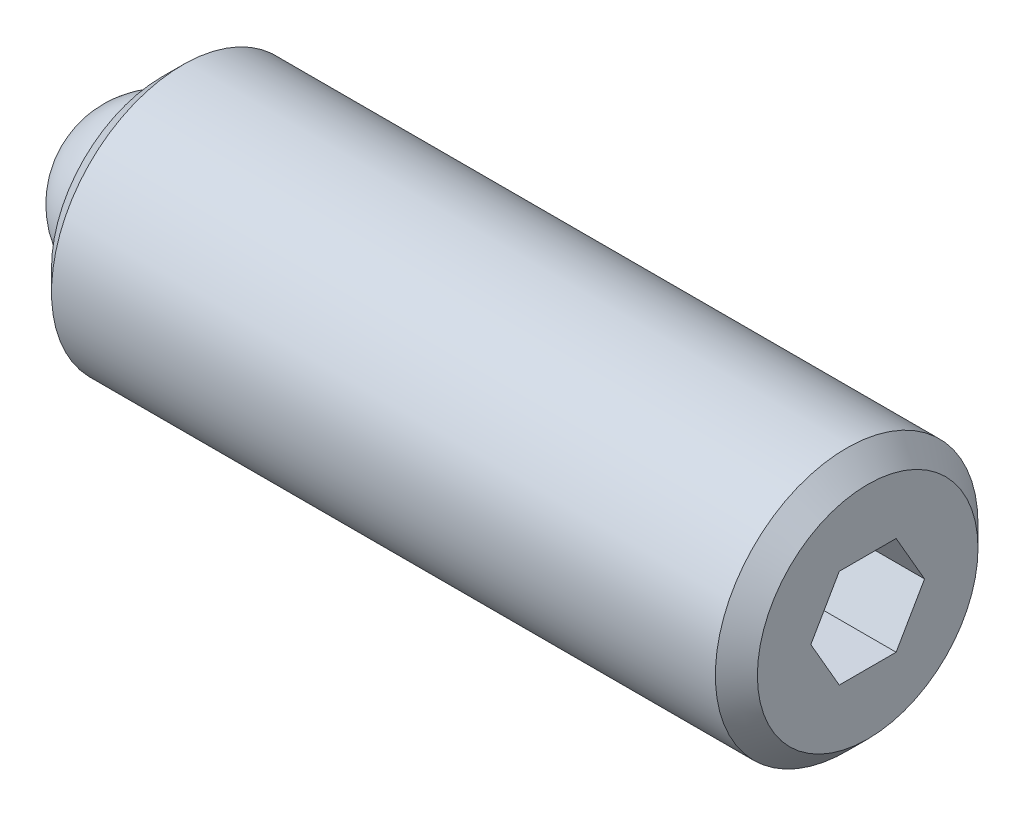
from build123d import *

# Parameters (mm, degrees)
SKETCH2_R           = 3.175
BOSS_EXTRUDE1_DEPTH = 17.065625
CHAMFER1_SIZE       = 0.508
CHAMFER2_SIZE       = 0.508
CUT_EXTRUDE2_DEPTH  = 2.286
SKETCH3_R           = 1.9812
CUT_EXTRUDE3_DEPTH  = 1.984375


with BuildPart() as part:
    # Sketch2 → Boss-Extrude1 (new body)
    with BuildSketch(Plane(origin=(0, 0, 0), x_dir=(0, 0, -1), z_dir=(1, 0, 0))):
        Circle(SKETCH2_R)
    extrude(amount=BOSS_EXTRUDE1_DEPTH)

    # Chamfer1
    chamfer1_edges = [part.edges().sort_by_distance(p)[0] for p in [
        (0, 0, 3.175),
    ]]
    chamfer(chamfer1_edges, length=CHAMFER1_SIZE)

    # Chamfer2
    chamfer2_edges = [part.edges().sort_by_distance(p)[0] for p in [
        (17.065625, 0, 3.175),
    ]]
    chamfer(chamfer2_edges, length=CHAMFER2_SIZE)

    # Sketch4 → Cut-Extrude2 (cut)
    with BuildSketch(Plane(origin=(17.065625, 0, 0), x_dir=(0, 0, -1), z_dir=(1, 0, 0))):
        Polygon((1.374815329, 0), (0.687407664, 1.190625), (-0.687407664, 1.190625), (-1.374815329, 0), (-0.687407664, -1.190625), (0.687407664, -1.190625), align=None)
    extrude(amount=-CUT_EXTRUDE2_DEPTH, mode=Mode.SUBTRACT)

    # Sketch3 → Cut-Extrude3 (cut)
    with BuildSketch(Plane.ZY):
        Circle(SKETCH3_R)
    extrude(amount=-CUT_EXTRUDE3_DEPTH, mode=Mode.SUBTRACT)


with BuildPart() as body_2:
    # Sketch5 → Revolve1 (revolve)
    with BuildSketch(Plane.ZY):
        with BuildLine():
            Line((0, 0), (0, -1.984375))
            ThreePointArc((0, -1.984375), (-1.984375, 0), (0, 1.984375))
            Line((0, 1.984375), (0, 0))
        make_face()
    revolve(axis=Axis((0, 0, 0), (0, 1, 0)))


solid = Compound([part.part, body_2.part])
